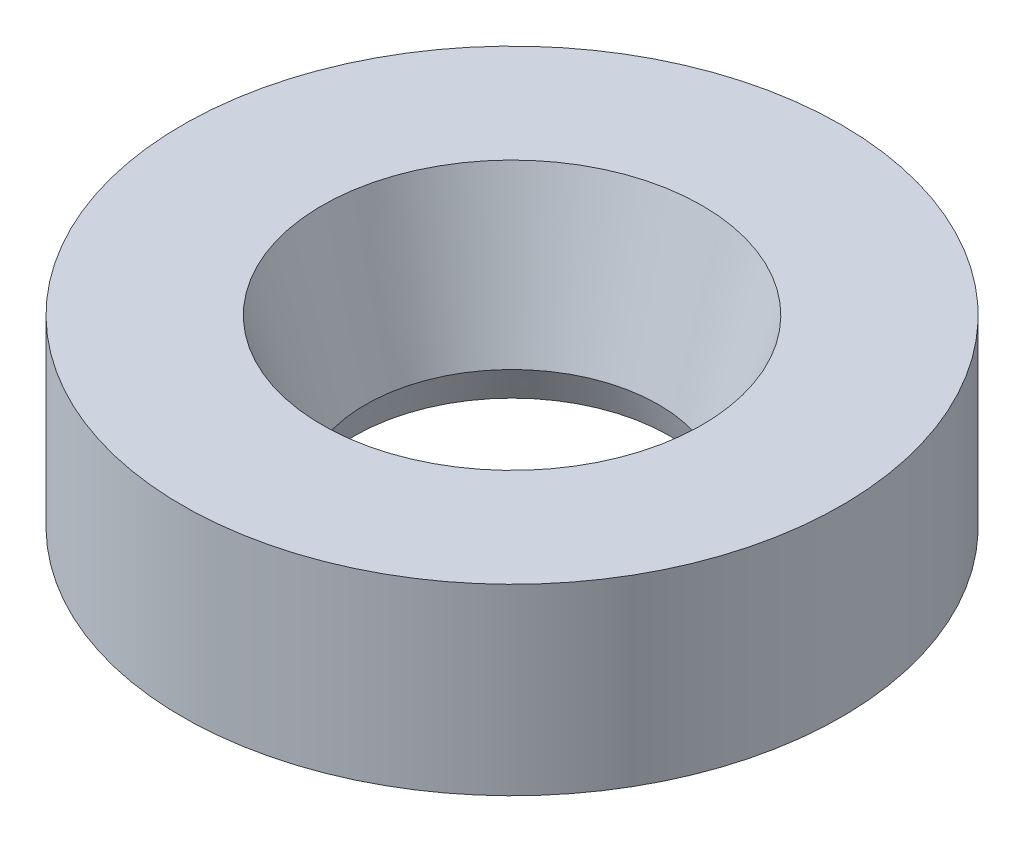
from build123d import *


with BuildPart() as part:
    # Sketch1 → Revolve1 (revolve)
    with BuildSketch(Plane.XY, mode=Mode.PRIVATE) as revolve1_sk:
        Polygon((4.30022, 0), (8.99922, 0), (8.99922, 5.00126), (5.18922, 5.00126), (4.0005, 0.889), align=None)
    revolve(revolve1_sk.sketch.rotate(Axis((0, 0, 0), (0, 1, 0)), 90), axis=Axis((0, 0, 0), (0, 1, 0)))


solid = part.part
